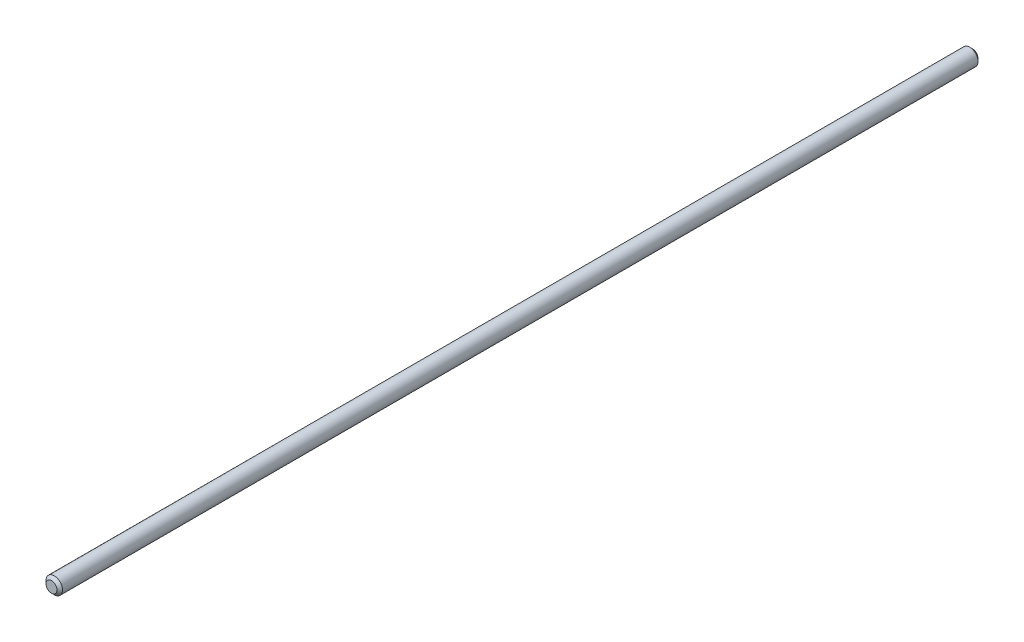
from build123d import *

# Parameters (mm, degrees)
ESQUISSE1_R          = 3
BASE_EXTRUSION_DEPTH = 335
CHANFREIN1_SIZE      = 1


with BuildPart() as part:
    # Esquisse1 → Base-Extrusion (new body)
    with BuildSketch(Plane.XY):
        Circle(ESQUISSE1_R)
    extrude(amount=BASE_EXTRUSION_DEPTH)

    # Chanfrein1
    chanfrein1_edges = [part.edges().sort_by_distance(p)[0] for p in [
        (-3, 0, 0),
        (-3, 0, 335),
    ]]
    chamfer(chanfrein1_edges, length=CHANFREIN1_SIZE)


solid = part.part
